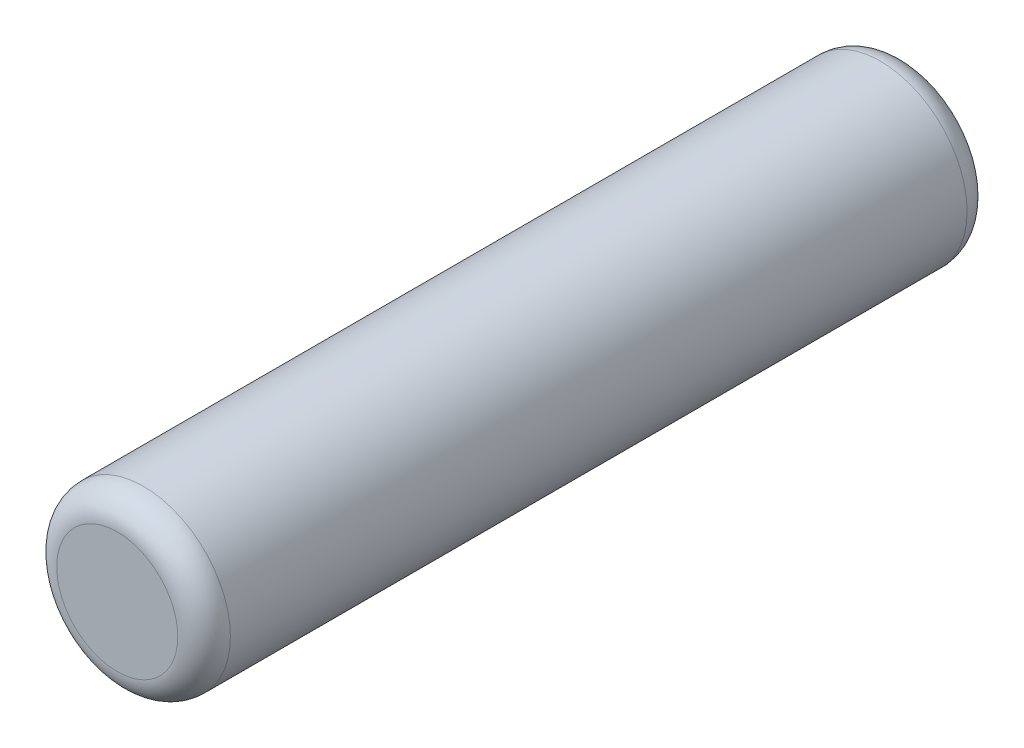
from build123d import *

# Parameters (mm, degrees)
ESQUISSE3_R      = 3.3
EXTRUSION2_DEPTH = 30
CONG_2_R         = 1


with BuildPart() as part:
    # Esquisse3 → Extrusion2 (new body)
    with BuildSketch(Plane.XY):
        Circle(ESQUISSE3_R)
    extrude(amount=EXTRUSION2_DEPTH)

    # Cong_2
    cong_2_edges = [part.edges().sort_by_distance(p)[0] for p in [
        (-3.3, 0, 0),
        (-3.3, 0, 30),
    ]]
    fillet(cong_2_edges, radius=CONG_2_R)


solid = part.part
